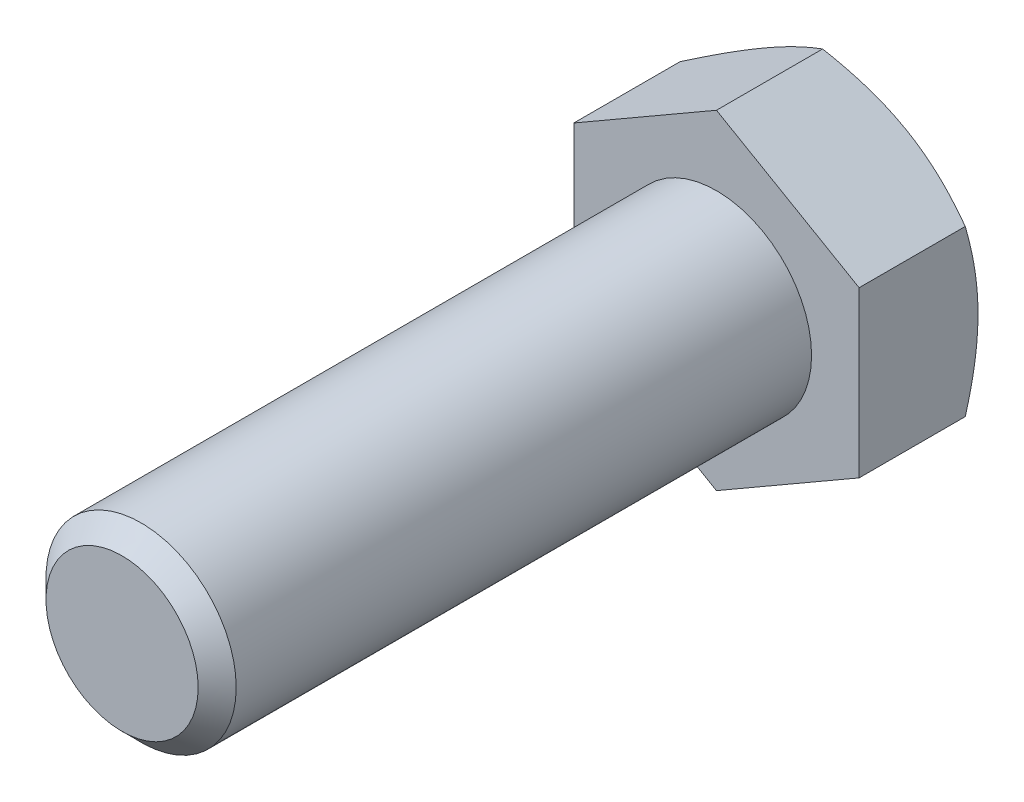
from build123d import *

# Parameters (mm, degrees)
ESQUISSE1_W        = 8
ESQUISSE1_H        = 50
CHANFREIN1_SIZE    = 1.6
BOSS_EXTRU_1_DEPTH = 10


with BuildPart() as part:
    # Esquisse1 → Base-R_volution (revolve)
    with BuildSketch(Plane(origin=(0, 0, 0), x_dir=(1, 0, 0), z_dir=(0, 1, 0))):
        with Locations((4, -25)):
            Rectangle(ESQUISSE1_W, ESQUISSE1_H)
    revolve(axis=Axis((0, 0, 0), (0, 0, 1)))

    # Chanfrein1
    chanfrein1_edges = [part.edges().sort_by_distance(p)[0] for p in [
        (-8, 0, 50),
    ]]
    chamfer(chanfrein1_edges, length=CHANFREIN1_SIZE)

    # Esquisse6 → Boss.-Extru.1 (add)
    with BuildSketch(Plane.XY):
        Polygon((12, -6.92820323), (12, 6.92820323), (0, 13.856406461), (-12, 6.92820323), (-12, -6.92820323), (0, -13.856406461), align=None)
    extrude(amount=-BOSS_EXTRU_1_DEPTH)

    # Esquisse7 → Enl_vement de mati_re-R_volution1 (revolve, cut)
    with BuildSketch(Plane(origin=(0, 0, 0), x_dir=(1, 0, 0), z_dir=(0, 1, 0))):
        Polygon((-12, 10), (-29.320508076, 10), (-29.320508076, 0), align=None)
    revolve(axis=Axis((0, 0, -6.239446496), (0, 0, 1)), mode=Mode.SUBTRACT)


solid = part.part
